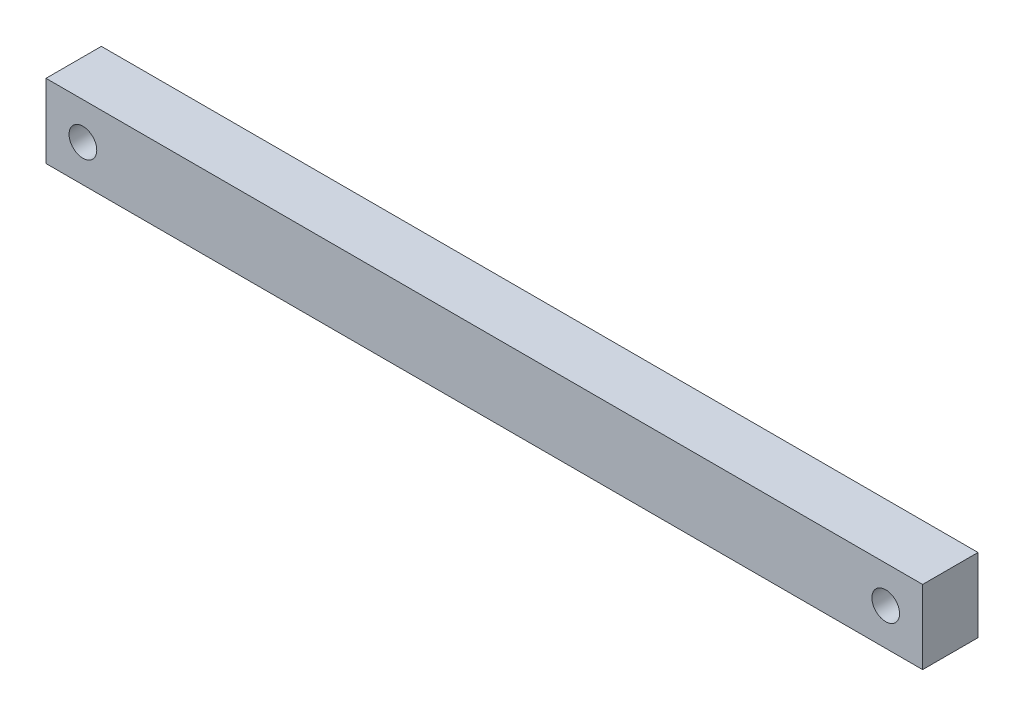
from build123d import *

# Parameters (mm, degrees)
ESQUISSE1_W      = 95
ESQUISSE1_H      = 8
ESQUISSE1_R      = 1.5
EXTRUSION1_DEPTH = 6


with BuildPart() as part:
    # Esquisse1 → Extrusion1 (new body)
    with BuildSketch(Plane.XY):
        with Locations((43.5, 0)):
            Rectangle(ESQUISSE1_W, ESQUISSE1_H)
        Circle(ESQUISSE1_R, mode=Mode.SUBTRACT)
        with Locations((87, 0)):
            Circle(ESQUISSE1_R, mode=Mode.SUBTRACT)
    extrude(amount=EXTRUSION1_DEPTH)


solid = part.part
